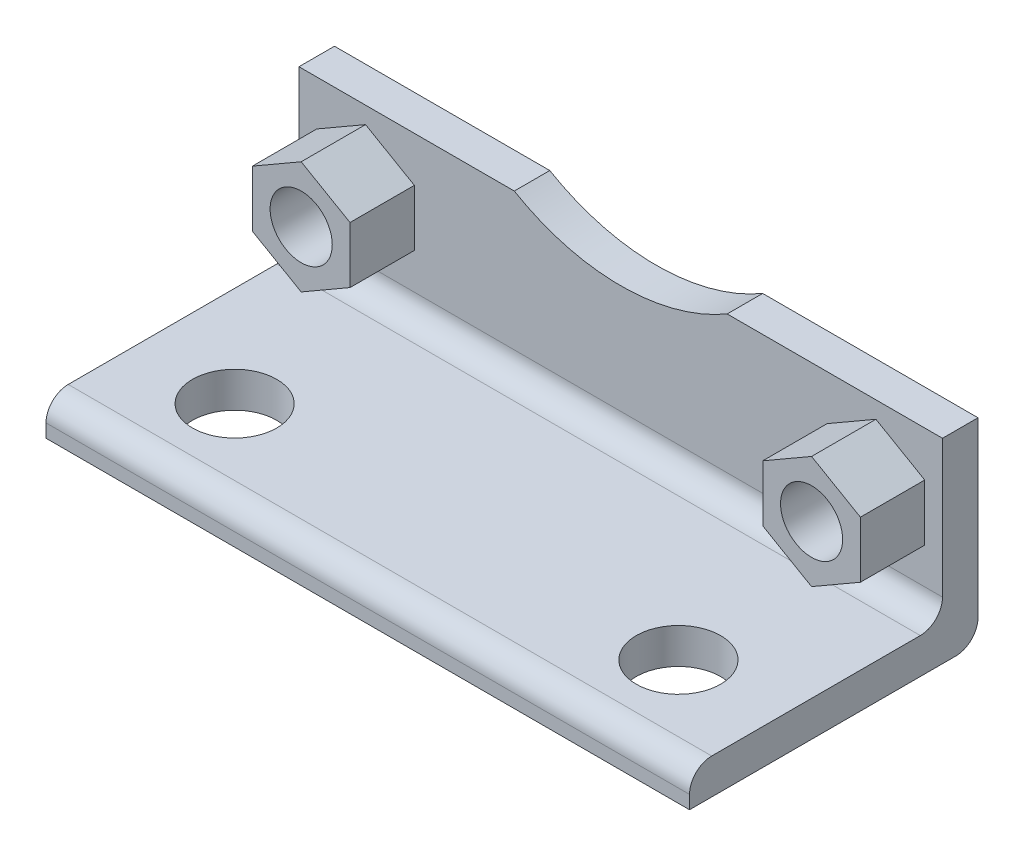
from build123d import *

# Parameters (mm, degrees)
BASE_EXTRUDE_DEPTH = 72.5
SKETCH2_R          = 9.5
MOUNTS_DEPTH       = 93.613443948
SKETCH3_R          = 7
BODYMOUNTS_DEPTH   = 126.420293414
NUTS_START         = 14.5
SKETCH4_R          = 7
NUTS_DEPTH         = 14.5
FILLET1_R          = 5
SKETCH5_R          = 47.5
CUT_EXTRUDE1_DEPTH = 126.420293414


with BuildPart() as part:
    # Sketch1 → Base-Extrude (new, symmetric)
    with BuildSketch(Plane(origin=(0, 0, 0), x_dir=(0, 0, -1), z_dir=(1, 0, 0))):
        Polygon((45, -41), (45, -85), (-20, -85), (-20, -77), (37, -77), (37, -41), align=None)
    extrude(amount=BASE_EXTRUDE_DEPTH, both=True)

    # Sketch2 → Mounts (cut, through all)
    with BuildSketch(Plane(origin=(0, -77, 0), x_dir=(-1, 0, 0), z_dir=(0, 1, 0))):
        with Locations(Location((-50, 0, 0), (0, 0, 90))):
            Circle(SKETCH2_R)
        with Locations(Location((50, 0, 0), (0, 0, 270))):
            Circle(SKETCH2_R)
    extrude(amount=-MOUNTS_DEPTH, mode=Mode.SUBTRACT)

    # Sketch3 → BodyMounts (cut, through all)
    with BuildSketch(Plane.XY.offset(-37)):
        with Locations((57.5, -57.5)):
            Circle(SKETCH3_R)
        with Locations(Location((-57.5, -57.5, 0), (0, 0, 180))):
            Circle(SKETCH3_R)
    extrude(amount=-BODYMOUNTS_DEPTH, mode=Mode.SUBTRACT)

    # Sketch4 → Nuts (add)
    # profile 1 of 2: a face of its own
    with BuildSketch(Plane.XY.offset(-37).offset(NUTS_START)):
        Polygon((57.5, -70.201705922), (68.5, -63.850852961), (68.5, -51.149147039), (57.5, -44.798294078), (46.5, -51.149147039), (46.5, -63.850852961), align=None)
        with Locations((57.5, -57.5)):
            Circle(SKETCH4_R, mode=Mode.SUBTRACT)
    # profile 2 of 2: a face of its own
    with BuildSketch(Plane.XY.offset(-37).offset(NUTS_START)):
        Polygon((-57.5, -70.201705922), (-46.5, -63.850852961), (-46.5, -51.149147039), (-57.5, -44.798294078), (-68.5, -51.149147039), (-68.5, -63.850852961), align=None)
        with Locations((-57.5, -57.5)):
            Circle(SKETCH4_R, mode=Mode.SUBTRACT)
    extrude(amount=-NUTS_DEPTH)

    # Fillet1
    fillet1_edges = [part.edges().sort_by_distance(p)[0] for p in [
        (0, -77, 20),
        (0, -77, -37),
        (0, -85, -45),
    ]]
    fillet(fillet1_edges, radius=FILLET1_R)

    # Sketch5 → Cut-Extrude1 (cut, through all)
    with BuildSketch(Plane.XY.offset(-37)):
        Circle(SKETCH5_R)
    extrude(amount=-CUT_EXTRUDE1_DEPTH, mode=Mode.SUBTRACT)


solid = part.part
